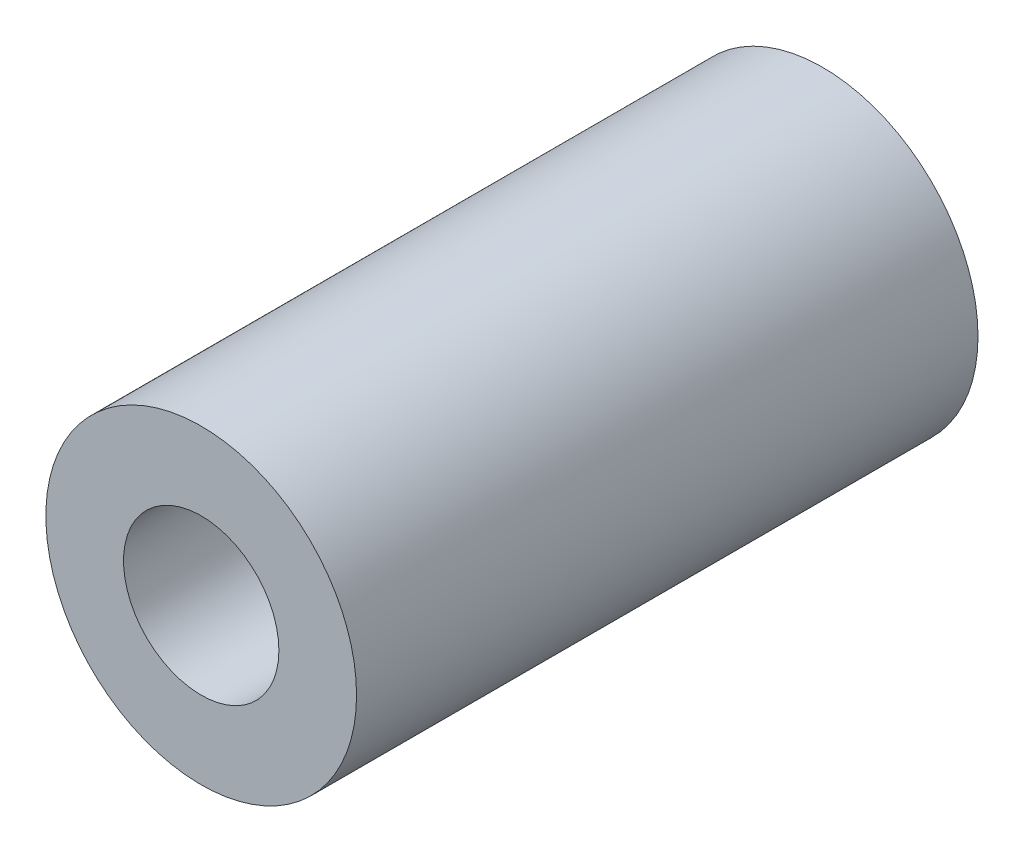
ISO-10303-21;
HEADER;
FILE_DESCRIPTION(('STEP AP214'),'2;1');
FILE_NAME('part.step','',(''),(''),'','','');
FILE_SCHEMA(('AUTOMOTIVE_DESIGN { 1 0 10303 214 1 1 1 1 }'));
ENDSEC;
DATA;
#1=APPLICATION_CONTEXT('core data for automotive mechanical design processes');
#2=APPLICATION_PROTOCOL_DEFINITION('international standard','automotive_design',2000,#1);
#3=PRODUCT_CONTEXT('',#1,'mechanical');
#4=PRODUCT('Part','Part','',(#3));
#5=PRODUCT_RELATED_PRODUCT_CATEGORY('part','',(#4));
#6=PRODUCT_DEFINITION_FORMATION('','',#4);
#7=PRODUCT_DEFINITION_CONTEXT('part definition',#1,'design');
#8=PRODUCT_DEFINITION('design','',#6,#7);
#9=PRODUCT_DEFINITION_SHAPE('','',#8);
#10=(LENGTH_UNIT() NAMED_UNIT(*) SI_UNIT(.MILLI.,.METRE.));
#11=(NAMED_UNIT(*) PLANE_ANGLE_UNIT() SI_UNIT($,.RADIAN.));
#12=(NAMED_UNIT(*) SI_UNIT($,.STERADIAN.) SOLID_ANGLE_UNIT());
#13=UNCERTAINTY_MEASURE_WITH_UNIT(LENGTH_MEASURE(1.E-05),#10,'distance_accuracy_value','');
#14=(GEOMETRIC_REPRESENTATION_CONTEXT(3) GLOBAL_UNCERTAINTY_ASSIGNED_CONTEXT((#13)) GLOBAL_UNIT_ASSIGNED_CONTEXT((#10,
#11,#12)) REPRESENTATION_CONTEXT('',''));
#15=CARTESIAN_POINT('',(0.,0.,0.));
#16=DIRECTION('',(0.,0.,1.));
#17=DIRECTION('',(1.,0.,0.));
#18=AXIS2_PLACEMENT_3D('',#15,#16,#17);
#19=CARTESIAN_POINT('',(10.,0.,22.));
#20=DIRECTION('',(0.,0.,-1.));
#21=DIRECTION('',(-1.,0.,0.));
#22=AXIS2_PLACEMENT_3D('',#19,#20,#21);
#23=PLANE('',#22);
#24=CARTESIAN_POINT('',(0.,0.,22.));
#25=DIRECTION('',(0.,0.,1.));
#26=DIRECTION('',(1.,0.,0.));
#27=AXIS2_PLACEMENT_3D('',#24,#25,#26);
#28=CIRCLE('',#27,7.);
#29=CARTESIAN_POINT('',(7.,0.,22.));
#30=VERTEX_POINT('',#29);
#31=EDGE_CURVE('E8',#30,#30,#28,.T.);
#32=ORIENTED_EDGE('',*,*,#31,.F.);
#33=EDGE_LOOP('',(#32));
#34=FACE_BOUND('',#33,.T.);
#35=CARTESIAN_POINT('',(0.,0.,22.));
#36=DIRECTION('',(0.,0.,1.));
#37=DIRECTION('',(1.,0.,0.));
#38=AXIS2_PLACEMENT_3D('',#35,#36,#37);
#39=CIRCLE('',#38,10.);
#40=CARTESIAN_POINT('',(10.,0.,22.));
#41=VERTEX_POINT('',#40);
#42=EDGE_CURVE('E34',#41,#41,#39,.T.);
#43=ORIENTED_EDGE('',*,*,#42,.T.);
#44=EDGE_LOOP('',(#43));
#45=FACE_BOUND('',#44,.T.);
#46=ADVANCED_FACE('F12',(#34,#45),#23,.F.);
#47=CARTESIAN_POINT('',(0.,0.,40.));
#48=DIRECTION('',(0.,0.,1.));
#49=DIRECTION('',(1.,0.,0.));
#50=AXIS2_PLACEMENT_3D('',#47,#48,#49);
#51=CYLINDRICAL_SURFACE('',#50,7.);
#52=CARTESIAN_POINT('',(0.,0.,0.));
#53=DIRECTION('',(0.,0.,1.));
#54=DIRECTION('',(1.,0.,0.));
#55=AXIS2_PLACEMENT_3D('',#52,#53,#54);
#56=CIRCLE('',#55,7.);
#57=CARTESIAN_POINT('',(7.,0.,0.));
#58=VERTEX_POINT('',#57);
#59=EDGE_CURVE('E18',#58,#58,#56,.T.);
#60=ORIENTED_EDGE('',*,*,#59,.F.);
#61=EDGE_LOOP('',(#60));
#62=FACE_BOUND('',#61,.T.);
#63=ORIENTED_EDGE('',*,*,#31,.T.);
#64=EDGE_LOOP('',(#63));
#65=FACE_BOUND('',#64,.T.);
#66=ADVANCED_FACE('F59',(#62,#65),#51,.F.);
#67=CARTESIAN_POINT('',(7.,0.,0.));
#68=DIRECTION('',(0.,0.,1.));
#69=DIRECTION('',(1.,0.,0.));
#70=AXIS2_PLACEMENT_3D('',#67,#68,#69);
#71=PLANE('',#70);
#72=CARTESIAN_POINT('',(0.,0.,0.));
#73=DIRECTION('',(0.,0.,1.));
#74=DIRECTION('',(1.,0.,0.));
#75=AXIS2_PLACEMENT_3D('',#72,#73,#74);
#76=CIRCLE('',#75,20.);
#77=CARTESIAN_POINT('',(20.,0.,0.));
#78=VERTEX_POINT('',#77);
#79=EDGE_CURVE('E22',#78,#78,#76,.T.);
#80=ORIENTED_EDGE('',*,*,#79,.F.);
#81=EDGE_LOOP('',(#80));
#82=FACE_BOUND('',#81,.T.);
#83=ORIENTED_EDGE('',*,*,#59,.T.);
#84=EDGE_LOOP('',(#83));
#85=FACE_BOUND('',#84,.T.);
#86=ADVANCED_FACE('F54',(#82,#85),#71,.F.);
#87=CARTESIAN_POINT('',(0.,0.,40.));
#88=DIRECTION('',(0.,0.,1.));
#89=DIRECTION('',(1.,0.,0.));
#90=AXIS2_PLACEMENT_3D('',#87,#88,#89);
#91=CYLINDRICAL_SURFACE('',#90,20.);
#92=CARTESIAN_POINT('',(0.,0.,80.));
#93=DIRECTION('',(0.,0.,1.));
#94=DIRECTION('',(1.,0.,0.));
#95=AXIS2_PLACEMENT_3D('',#92,#93,#94);
#96=CIRCLE('',#95,20.);
#97=CARTESIAN_POINT('',(20.,0.,80.));
#98=VERTEX_POINT('',#97);
#99=EDGE_CURVE('E26',#98,#98,#96,.T.);
#100=ORIENTED_EDGE('',*,*,#99,.F.);
#101=EDGE_LOOP('',(#100));
#102=FACE_BOUND('',#101,.T.);
#103=ORIENTED_EDGE('',*,*,#79,.T.);
#104=EDGE_LOOP('',(#103));
#105=FACE_BOUND('',#104,.T.);
#106=ADVANCED_FACE('F48',(#102,#105),#91,.T.);
#107=CARTESIAN_POINT('',(20.,0.,80.));
#108=DIRECTION('',(0.,0.,-1.));
#109=DIRECTION('',(-1.,0.,0.));
#110=AXIS2_PLACEMENT_3D('',#107,#108,#109);
#111=PLANE('',#110);
#112=CARTESIAN_POINT('',(0.,0.,80.));
#113=DIRECTION('',(0.,0.,1.));
#114=DIRECTION('',(1.,0.,0.));
#115=AXIS2_PLACEMENT_3D('',#112,#113,#114);
#116=CIRCLE('',#115,10.);
#117=CARTESIAN_POINT('',(10.,0.,80.));
#118=VERTEX_POINT('',#117);
#119=EDGE_CURVE('E31',#118,#118,#116,.T.);
#120=ORIENTED_EDGE('',*,*,#119,.F.);
#121=EDGE_LOOP('',(#120));
#122=FACE_BOUND('',#121,.T.);
#123=ORIENTED_EDGE('',*,*,#99,.T.);
#124=EDGE_LOOP('',(#123));
#125=FACE_BOUND('',#124,.T.);
#126=ADVANCED_FACE('F42',(#122,#125),#111,.F.);
#127=CARTESIAN_POINT('',(0.,0.,40.));
#128=DIRECTION('',(0.,0.,1.));
#129=DIRECTION('',(1.,0.,0.));
#130=AXIS2_PLACEMENT_3D('',#127,#128,#129);
#131=CYLINDRICAL_SURFACE('',#130,10.);
#132=ORIENTED_EDGE('',*,*,#42,.F.);
#133=EDGE_LOOP('',(#132));
#134=FACE_BOUND('',#133,.T.);
#135=ORIENTED_EDGE('',*,*,#119,.T.);
#136=EDGE_LOOP('',(#135));
#137=FACE_BOUND('',#136,.T.);
#138=ADVANCED_FACE('F39',(#134,#137),#131,.F.);
#139=CLOSED_SHELL('',(#46,#66,#86,#106,#126,#138));
#140=MANIFOLD_SOLID_BREP('B1',#139);
#141=ADVANCED_BREP_SHAPE_REPRESENTATION('',(#18,#140),#14);
#142=SHAPE_DEFINITION_REPRESENTATION(#9,#141);
ENDSEC;
END-ISO-10303-21;
